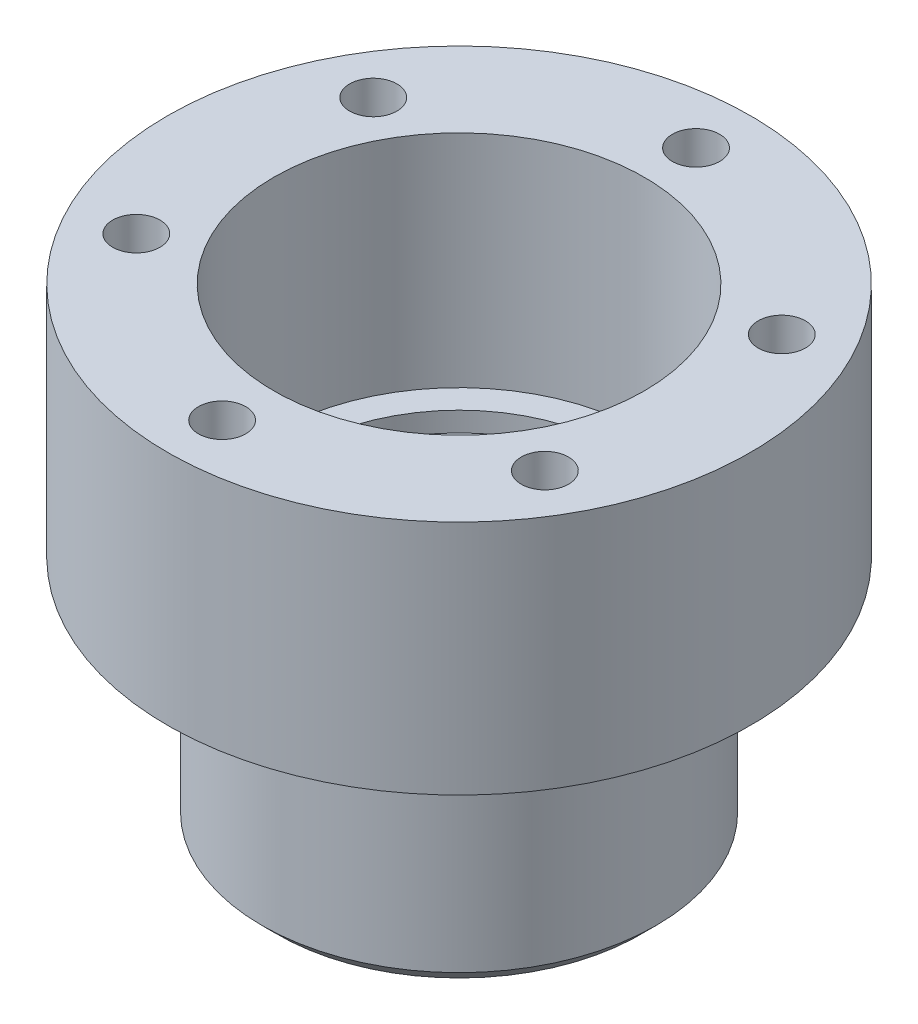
ISO-10303-21;
HEADER;
FILE_DESCRIPTION(('STEP AP214'),'2;1');
FILE_NAME('part.step','',(''),(''),'','','');
FILE_SCHEMA(('AUTOMOTIVE_DESIGN { 1 0 10303 214 1 1 1 1 }'));
ENDSEC;
DATA;
#1=APPLICATION_CONTEXT('core data for automotive mechanical design processes');
#2=APPLICATION_PROTOCOL_DEFINITION('international standard','automotive_design',2000,#1);
#3=PRODUCT_CONTEXT('',#1,'mechanical');
#4=PRODUCT('Part','Part','',(#3));
#5=PRODUCT_RELATED_PRODUCT_CATEGORY('part','',(#4));
#6=PRODUCT_DEFINITION_FORMATION('','',#4);
#7=PRODUCT_DEFINITION_CONTEXT('part definition',#1,'design');
#8=PRODUCT_DEFINITION('design','',#6,#7);
#9=PRODUCT_DEFINITION_SHAPE('','',#8);
#10=(LENGTH_UNIT() NAMED_UNIT(*) SI_UNIT(.MILLI.,.METRE.));
#11=(NAMED_UNIT(*) PLANE_ANGLE_UNIT() SI_UNIT($,.RADIAN.));
#12=(NAMED_UNIT(*) SI_UNIT($,.STERADIAN.) SOLID_ANGLE_UNIT());
#13=UNCERTAINTY_MEASURE_WITH_UNIT(LENGTH_MEASURE(1.E-05),#10,'distance_accuracy_value','');
#14=(GEOMETRIC_REPRESENTATION_CONTEXT(3) GLOBAL_UNCERTAINTY_ASSIGNED_CONTEXT((#13)) GLOBAL_UNIT_ASSIGNED_CONTEXT((#10,
#11,#12)) REPRESENTATION_CONTEXT('',''));
#15=CARTESIAN_POINT('',(0.,0.,0.));
#16=DIRECTION('',(0.,0.,1.));
#17=DIRECTION('',(1.,0.,0.));
#18=AXIS2_PLACEMENT_3D('',#15,#16,#17);
#19=CARTESIAN_POINT('',(-7.02103754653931,-29.6345611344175,0.));
#20=DIRECTION('',(0.,-1.,0.));
#21=DIRECTION('',(0.,0.,-1.));
#22=AXIS2_PLACEMENT_3D('',#19,#20,#21);
#23=PLANE('',#22);
#24=CARTESIAN_POINT('',(13.6039624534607,-29.6345611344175,0.));
#25=DIRECTION('',(0.,1.,0.));
#26=DIRECTION('',(-1.,0.,0.));
#27=AXIS2_PLACEMENT_3D('',#24,#25,#26);
#28=CIRCLE('',#27,20.);
#29=CARTESIAN_POINT('',(-6.39603754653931,-29.6345611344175,0.));
#30=VERTEX_POINT('',#29);
#31=EDGE_CURVE('E18',#30,#30,#28,.T.);
#32=ORIENTED_EDGE('',*,*,#31,.T.);
#33=EDGE_LOOP('',(#32));
#34=FACE_BOUND('',#33,.T.);
#35=CARTESIAN_POINT('',(13.6039624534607,-29.6345611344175,0.));
#36=DIRECTION('',(0.,1.,0.));
#37=DIRECTION('',(-1.,0.,0.));
#38=AXIS2_PLACEMENT_3D('',#35,#36,#37);
#39=CIRCLE('',#38,21.25);
#40=CARTESIAN_POINT('',(-7.6460375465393,-29.6345611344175,0.));
#41=VERTEX_POINT('',#40);
#42=EDGE_CURVE('E102',#41,#41,#39,.F.);
#43=ORIENTED_EDGE('',*,*,#42,.T.);
#44=EDGE_LOOP('',(#43));
#45=FACE_BOUND('',#44,.T.);
#46=ADVANCED_FACE('F14',(#34,#45),#23,.T.);
#47=CARTESIAN_POINT('',(13.6039624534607,-20.8845611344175,0.));
#48=DIRECTION('',(0.,1.,0.));
#49=DIRECTION('',(-1.,0.,0.));
#50=AXIS2_PLACEMENT_3D('',#47,#48,#49);
#51=CYLINDRICAL_SURFACE('',#50,20.);
#52=ORIENTED_EDGE('',*,*,#31,.F.);
#53=EDGE_LOOP('',(#52));
#54=FACE_BOUND('',#53,.T.);
#55=CARTESIAN_POINT('',(13.6039624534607,-12.1345611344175,0.));
#56=DIRECTION('',(0.,1.,0.));
#57=DIRECTION('',(-1.,0.,0.));
#58=AXIS2_PLACEMENT_3D('',#55,#56,#57);
#59=CIRCLE('',#58,20.);
#60=CARTESIAN_POINT('',(-6.39603754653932,-12.1345611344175,0.));
#61=VERTEX_POINT('',#60);
#62=EDGE_CURVE('E100',#61,#61,#59,.F.);
#63=ORIENTED_EDGE('',*,*,#62,.F.);
#64=EDGE_LOOP('',(#63));
#65=FACE_BOUND('',#64,.T.);
#66=ADVANCED_FACE('F110',(#54,#65),#51,.F.);
#67=CARTESIAN_POINT('',(13.6039624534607,-30.5595611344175,0.));
#68=DIRECTION('',(0.,1.,0.));
#69=DIRECTION('',(-1.,0.,0.));
#70=AXIS2_PLACEMENT_3D('',#67,#68,#69);
#71=CYLINDRICAL_SURFACE('',#70,21.25);
#72=CARTESIAN_POINT('',(13.6039624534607,-31.4845611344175,0.));
#73=DIRECTION('',(0.,1.,0.));
#74=DIRECTION('',(-1.,0.,0.));
#75=AXIS2_PLACEMENT_3D('',#72,#73,#74);
#76=CIRCLE('',#75,21.25);
#77=CARTESIAN_POINT('',(-7.6460375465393,-31.4845611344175,0.));
#78=VERTEX_POINT('',#77);
#79=EDGE_CURVE('E97',#78,#78,#76,.T.);
#80=ORIENTED_EDGE('',*,*,#79,.F.);
#81=EDGE_LOOP('',(#80));
#82=FACE_BOUND('',#81,.T.);
#83=ORIENTED_EDGE('',*,*,#42,.F.);
#84=EDGE_LOOP('',(#83));
#85=FACE_BOUND('',#84,.T.);
#86=ADVANCED_FACE('F113',(#82,#85),#71,.F.);
#87=CARTESIAN_POINT('',(-4.39603754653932,-12.1345611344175,0.));
#88=DIRECTION('',(0.,-1.,0.));
#89=DIRECTION('',(0.,0.,-1.));
#90=AXIS2_PLACEMENT_3D('',#87,#88,#89);
#91=PLANE('',#90);
#92=CARTESIAN_POINT('',(13.6039624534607,-12.1345611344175,0.));
#93=DIRECTION('',(0.,1.,0.));
#94=DIRECTION('',(-1.,0.,0.));
#95=AXIS2_PLACEMENT_3D('',#92,#93,#94);
#96=CIRCLE('',#95,16.);
#97=CARTESIAN_POINT('',(-2.39603754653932,-12.1345611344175,0.));
#98=VERTEX_POINT('',#97);
#99=EDGE_CURVE('E94',#98,#98,#96,.T.);
#100=ORIENTED_EDGE('',*,*,#99,.T.);
#101=EDGE_LOOP('',(#100));
#102=FACE_BOUND('',#101,.T.);
#103=ORIENTED_EDGE('',*,*,#62,.T.);
#104=EDGE_LOOP('',(#103));
#105=FACE_BOUND('',#104,.T.);
#106=ADVANCED_FACE('F117',(#102,#105),#91,.T.);
#107=CARTESIAN_POINT('',(-7.02103754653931,-31.4845611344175,0.));
#108=DIRECTION('',(0.,1.,0.));
#109=DIRECTION('',(0.,0.,1.));
#110=AXIS2_PLACEMENT_3D('',#107,#108,#109);
#111=PLANE('',#110);
#112=CARTESIAN_POINT('',(13.6039624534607,-31.4845611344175,0.));
#113=DIRECTION('',(0.,1.,0.));
#114=DIRECTION('',(-1.,0.,0.));
#115=AXIS2_PLACEMENT_3D('',#112,#113,#114);
#116=CIRCLE('',#115,20.);
#117=CARTESIAN_POINT('',(-6.39603754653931,-31.4845611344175,0.));
#118=VERTEX_POINT('',#117);
#119=EDGE_CURVE('E91',#118,#118,#116,.F.);
#120=ORIENTED_EDGE('',*,*,#119,.T.);
#121=EDGE_LOOP('',(#120));
#122=FACE_BOUND('',#121,.T.);
#123=ORIENTED_EDGE('',*,*,#79,.T.);
#124=EDGE_LOOP('',(#123));
#125=FACE_BOUND('',#124,.T.);
#126=ADVANCED_FACE('F119',(#122,#125),#111,.T.);
#127=CARTESIAN_POINT('',(13.6039624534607,-7.6345611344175,0.));
#128=DIRECTION('',(0.,1.,0.));
#129=DIRECTION('',(-1.,0.,0.));
#130=AXIS2_PLACEMENT_3D('',#127,#128,#129);
#131=CYLINDRICAL_SURFACE('',#130,16.);
#132=ORIENTED_EDGE('',*,*,#99,.F.);
#133=EDGE_LOOP('',(#132));
#134=FACE_BOUND('',#133,.T.);
#135=CARTESIAN_POINT('',(13.6039624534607,-3.1345611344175,0.));
#136=DIRECTION('',(0.,1.,0.));
#137=DIRECTION('',(-1.,0.,0.));
#138=AXIS2_PLACEMENT_3D('',#135,#136,#137);
#139=CIRCLE('',#138,16.);
#140=CARTESIAN_POINT('',(-2.39603754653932,-3.13456113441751,0.));
#141=VERTEX_POINT('',#140);
#142=EDGE_CURVE('E88',#141,#141,#139,.F.);
#143=ORIENTED_EDGE('',*,*,#142,.F.);
#144=EDGE_LOOP('',(#143));
#145=FACE_BOUND('',#144,.T.);
#146=ADVANCED_FACE('F125',(#134,#145),#131,.F.);
#147=CARTESIAN_POINT('',(13.6039624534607,-32.0595611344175,0.));
#148=DIRECTION('',(0.,1.,0.));
#149=DIRECTION('',(-1.,0.,0.));
#150=AXIS2_PLACEMENT_3D('',#147,#148,#149);
#151=CYLINDRICAL_SURFACE('',#150,20.);
#152=CARTESIAN_POINT('',(13.6039624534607,-32.6345611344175,0.));
#153=DIRECTION('',(0.,1.,0.));
#154=DIRECTION('',(-1.,0.,0.));
#155=AXIS2_PLACEMENT_3D('',#152,#153,#154);
#156=CIRCLE('',#155,20.);
#157=CARTESIAN_POINT('',(-6.39603754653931,-32.6345611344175,0.));
#158=VERTEX_POINT('',#157);
#159=EDGE_CURVE('E85',#158,#158,#156,.T.);
#160=ORIENTED_EDGE('',*,*,#159,.F.);
#161=EDGE_LOOP('',(#160));
#162=FACE_BOUND('',#161,.T.);
#163=ORIENTED_EDGE('',*,*,#119,.F.);
#164=EDGE_LOOP('',(#163));
#165=FACE_BOUND('',#164,.T.);
#166=ADVANCED_FACE('F214',(#162,#165),#151,.F.);
#167=CARTESIAN_POINT('',(-4.39603754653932,-3.13456113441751,0.));
#168=DIRECTION('',(0.,1.,0.));
#169=DIRECTION('',(0.,0.,1.));
#170=AXIS2_PLACEMENT_3D('',#167,#168,#169);
#171=PLANE('',#170);
#172=ORIENTED_EDGE('',*,*,#142,.T.);
#173=EDGE_LOOP('',(#172));
#174=FACE_BOUND('',#173,.T.);
#175=CARTESIAN_POINT('',(13.6039624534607,-3.1345611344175,0.));
#176=DIRECTION('',(0.,1.,0.));
#177=DIRECTION('',(-1.,0.,0.));
#178=AXIS2_PLACEMENT_3D('',#175,#176,#177);
#179=CIRCLE('',#178,20.);
#180=CARTESIAN_POINT('',(-6.39603754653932,-3.13456113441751,0.));
#181=VERTEX_POINT('',#180);
#182=EDGE_CURVE('E82',#181,#181,#179,.T.);
#183=ORIENTED_EDGE('',*,*,#182,.T.);
#184=EDGE_LOOP('',(#183));
#185=FACE_BOUND('',#184,.T.);
#186=ADVANCED_FACE('F210',(#174,#185),#171,.T.);
#187=CARTESIAN_POINT('',(-8.89603754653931,-32.6345611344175,0.));
#188=DIRECTION('',(0.,-1.,0.));
#189=DIRECTION('',(0.,0.,-1.));
#190=AXIS2_PLACEMENT_3D('',#187,#188,#189);
#191=PLANE('',#190);
#192=ORIENTED_EDGE('',*,*,#159,.T.);
#193=EDGE_LOOP('',(#192));
#194=FACE_BOUND('',#193,.T.);
#195=CARTESIAN_POINT('',(13.6039624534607,-32.6345611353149,0.));
#196=DIRECTION('',(0.,1.,0.));
#197=DIRECTION('',(-1.,0.,0.));
#198=AXIS2_PLACEMENT_3D('',#195,#196,#197);
#199=CIRCLE('',#198,23.0000000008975);
#200=CARTESIAN_POINT('',(-9.39603754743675,-32.634561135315,0.));
#201=VERTEX_POINT('',#200);
#202=EDGE_CURVE('E79',#201,#201,#199,.T.);
#203=ORIENTED_EDGE('',*,*,#202,.F.);
#204=EDGE_LOOP('',(#203));
#205=FACE_BOUND('',#204,.T.);
#206=ADVANCED_FACE('F206',(#194,#205),#191,.T.);
#207=CARTESIAN_POINT('',(13.6039624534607,12.1154388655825,0.));
#208=DIRECTION('',(0.,1.,0.));
#209=DIRECTION('',(-1.,0.,0.));
#210=AXIS2_PLACEMENT_3D('',#207,#208,#209);
#211=CYLINDRICAL_SURFACE('',#210,20.);
#212=ORIENTED_EDGE('',*,*,#182,.F.);
#213=EDGE_LOOP('',(#212));
#214=FACE_BOUND('',#213,.T.);
#215=CARTESIAN_POINT('',(13.6039624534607,-0.634561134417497,0.));
#216=DIRECTION('',(0.,1.,0.));
#217=DIRECTION('',(-1.,0.,0.));
#218=AXIS2_PLACEMENT_3D('',#215,#216,#217);
#219=CIRCLE('',#218,20.);
#220=CARTESIAN_POINT('',(-6.39603754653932,-0.634561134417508,0.));
#221=VERTEX_POINT('',#220);
#222=EDGE_CURVE('E76',#221,#221,#219,.T.);
#223=ORIENTED_EDGE('',*,*,#222,.T.);
#224=EDGE_LOOP('',(#223));
#225=FACE_BOUND('',#224,.T.);
#226=ADVANCED_FACE('F202',(#214,#225),#211,.F.);
#227=CARTESIAN_POINT('',(13.6039624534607,-30.63456113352,0.));
#228=DIRECTION('',(0.,1.,0.));
#229=DIRECTION('',(-1.,0.,0.));
#230=AXIS2_PLACEMENT_3D('',#227,#228,#229);
#231=CONICAL_SURFACE('',#230,24.9999999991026,0.7853981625);
#232=ORIENTED_EDGE('',*,*,#202,.T.);
#233=EDGE_LOOP('',(#232));
#234=FACE_BOUND('',#233,.T.);
#235=CARTESIAN_POINT('',(13.6039624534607,-30.6345611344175,0.));
#236=DIRECTION('',(0.,1.,0.));
#237=DIRECTION('',(-1.,0.,0.));
#238=AXIS2_PLACEMENT_3D('',#235,#236,#237);
#239=CIRCLE('',#238,25.);
#240=CARTESIAN_POINT('',(-11.3960375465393,-30.6345611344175,0.));
#241=VERTEX_POINT('',#240);
#242=EDGE_CURVE('E30',#241,#241,#239,.T.);
#243=ORIENTED_EDGE('',*,*,#242,.F.);
#244=EDGE_LOOP('',(#243));
#245=FACE_BOUND('',#244,.T.);
#246=ADVANCED_FACE('F198',(#234,#245),#231,.T.);
#247=CARTESIAN_POINT('',(13.6039624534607,-0.634561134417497,0.));
#248=DIRECTION('',(0.,-1.,0.));
#249=DIRECTION('',(0.,0.,-1.));
#250=AXIS2_PLACEMENT_3D('',#247,#248,#249);
#251=PLANE('',#250);
#252=ORIENTED_EDGE('',*,*,#222,.F.);
#253=EDGE_LOOP('',(#252));
#254=FACE_BOUND('',#253,.T.);
#255=CARTESIAN_POINT('',(13.6039624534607,-0.634561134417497,0.));
#256=DIRECTION('',(0.,-1.,0.));
#257=DIRECTION('',(1.,0.,0.));
#258=AXIS2_PLACEMENT_3D('',#255,#256,#257);
#259=CIRCLE('',#258,23.5);
#260=CARTESIAN_POINT('',(37.1039624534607,-0.634561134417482,0.));
#261=VERTEX_POINT('',#260);
#262=EDGE_CURVE('E73',#261,#261,#259,.F.);
#263=ORIENTED_EDGE('',*,*,#262,.T.);
#264=EDGE_LOOP('',(#263));
#265=FACE_BOUND('',#264,.T.);
#266=ADVANCED_FACE('F194',(#254,#265),#251,.F.);
#267=CARTESIAN_POINT('',(13.6039624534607,-17.6345611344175,0.));
#268=DIRECTION('',(0.,1.,0.));
#269=DIRECTION('',(-1.,0.,0.));
#270=AXIS2_PLACEMENT_3D('',#267,#268,#269);
#271=CYLINDRICAL_SURFACE('',#270,25.);
#272=CARTESIAN_POINT('',(13.6039624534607,-2.6345611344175,0.));
#273=DIRECTION('',(0.,1.,0.));
#274=DIRECTION('',(-1.,0.,0.));
#275=AXIS2_PLACEMENT_3D('',#272,#273,#274);
#276=CIRCLE('',#275,25.);
#277=CARTESIAN_POINT('',(-11.3960375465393,-2.63456113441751,0.));
#278=VERTEX_POINT('',#277);
#279=EDGE_CURVE('E52',#278,#278,#276,.T.);
#280=ORIENTED_EDGE('',*,*,#279,.F.);
#281=EDGE_LOOP('',(#280));
#282=FACE_BOUND('',#281,.T.);
#283=ORIENTED_EDGE('',*,*,#242,.T.);
#284=EDGE_LOOP('',(#283));
#285=FACE_BOUND('',#284,.T.);
#286=ADVANCED_FACE('F190',(#282,#285),#271,.T.);
#287=CARTESIAN_POINT('',(13.6039624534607,27.3654388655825,0.));
#288=DIRECTION('',(0.,-1.,0.));
#289=DIRECTION('',(1.,0.,0.));
#290=AXIS2_PLACEMENT_3D('',#287,#288,#289);
#291=CYLINDRICAL_SURFACE('',#290,23.5);
#292=ORIENTED_EDGE('',*,*,#262,.F.);
#293=EDGE_LOOP('',(#292));
#294=FACE_BOUND('',#293,.T.);
#295=CARTESIAN_POINT('',(13.6039624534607,27.3654388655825,0.));
#296=DIRECTION('',(0.,-1.,0.));
#297=DIRECTION('',(1.,0.,0.));
#298=AXIS2_PLACEMENT_3D('',#295,#296,#297);
#299=CIRCLE('',#298,23.5);
#300=CARTESIAN_POINT('',(37.1039624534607,27.3654388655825,0.));
#301=VERTEX_POINT('',#300);
#302=EDGE_CURVE('E49',#301,#301,#299,.T.);
#303=ORIENTED_EDGE('',*,*,#302,.F.);
#304=EDGE_LOOP('',(#303));
#305=FACE_BOUND('',#304,.T.);
#306=ADVANCED_FACE('F147',(#294,#305),#291,.F.);
#307=CARTESIAN_POINT('',(-12.3426675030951,27.3654388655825,-15.0591186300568));
#308=DIRECTION('',(0.,-1.,0.));
#309=DIRECTION('',(0.,0.,-1.));
#310=AXIS2_PLACEMENT_3D('',#307,#308,#309);
#311=CYLINDRICAL_SURFACE('',#310,3.);
#312=CARTESIAN_POINT('',(-12.3426675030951,27.3654388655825,-15.0591186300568));
#313=DIRECTION('',(0.,-1.,0.));
#314=DIRECTION('',(0.,0.,-1.));
#315=AXIS2_PLACEMENT_3D('',#312,#313,#314);
#316=CIRCLE('',#315,3.);
#317=CARTESIAN_POINT('',(-12.3426675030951,27.3654388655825,-18.0591186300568));
#318=VERTEX_POINT('',#317);
#319=EDGE_CURVE('E46',#318,#318,#316,.T.);
#320=ORIENTED_EDGE('',*,*,#319,.F.);
#321=EDGE_LOOP('',(#320));
#322=FACE_BOUND('',#321,.T.);
#323=CARTESIAN_POINT('',(-12.3426675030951,-2.63456113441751,-15.0591186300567));
#324=DIRECTION('',(0.,-1.,0.));
#325=DIRECTION('',(0.,0.,-1.));
#326=AXIS2_PLACEMENT_3D('',#323,#324,#325);
#327=CIRCLE('',#326,3.);
#328=CARTESIAN_POINT('',(-12.3426675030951,-2.63456113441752,-18.0591186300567));
#329=VERTEX_POINT('',#328);
#330=EDGE_CURVE('E70',#329,#329,#327,.F.);
#331=ORIENTED_EDGE('',*,*,#330,.F.);
#332=EDGE_LOOP('',(#331));
#333=FACE_BOUND('',#332,.T.);
#334=ADVANCED_FACE('F143',(#322,#333),#311,.F.);
#335=CARTESIAN_POINT('',(13.6722267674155,27.3654388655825,-30.));
#336=DIRECTION('',(0.,-1.,0.));
#337=DIRECTION('',(0.,0.,-1.));
#338=AXIS2_PLACEMENT_3D('',#335,#336,#337);
#339=CYLINDRICAL_SURFACE('',#338,3.);
#340=CARTESIAN_POINT('',(13.6722267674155,27.3654388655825,-30.));
#341=DIRECTION('',(0.,-1.,0.));
#342=DIRECTION('',(0.,0.,-1.));
#343=AXIS2_PLACEMENT_3D('',#340,#341,#342);
#344=CIRCLE('',#343,3.);
#345=CARTESIAN_POINT('',(13.6722267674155,27.3654388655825,-33.));
#346=VERTEX_POINT('',#345);
#347=EDGE_CURVE('E43',#346,#346,#344,.T.);
#348=ORIENTED_EDGE('',*,*,#347,.F.);
#349=EDGE_LOOP('',(#348));
#350=FACE_BOUND('',#349,.T.);
#351=CARTESIAN_POINT('',(13.6722267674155,-2.63456113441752,-30.));
#352=DIRECTION('',(0.,-1.,0.));
#353=DIRECTION('',(0.,0.,-1.));
#354=AXIS2_PLACEMENT_3D('',#351,#352,#353);
#355=CIRCLE('',#354,3.);
#356=CARTESIAN_POINT('',(13.6722267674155,-2.63456113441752,-33.));
#357=VERTEX_POINT('',#356);
#358=EDGE_CURVE('E67',#357,#357,#355,.F.);
#359=ORIENTED_EDGE('',*,*,#358,.F.);
#360=EDGE_LOOP('',(#359));
#361=FACE_BOUND('',#360,.T.);
#362=ADVANCED_FACE('F146',(#350,#361),#339,.F.);
#363=CARTESIAN_POINT('',(39.6188567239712,27.3654388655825,-14.9408813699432));
#364=DIRECTION('',(0.,-1.,0.));
#365=DIRECTION('',(0.,0.,-1.));
#366=AXIS2_PLACEMENT_3D('',#363,#364,#365);
#367=CYLINDRICAL_SURFACE('',#366,3.);
#368=CARTESIAN_POINT('',(39.6188567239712,27.3654388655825,-14.9408813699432));
#369=DIRECTION('',(0.,-1.,0.));
#370=DIRECTION('',(0.,0.,-1.));
#371=AXIS2_PLACEMENT_3D('',#368,#369,#370);
#372=CIRCLE('',#371,3.);
#373=CARTESIAN_POINT('',(39.6188567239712,27.3654388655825,-17.9408813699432));
#374=VERTEX_POINT('',#373);
#375=EDGE_CURVE('E40',#374,#374,#372,.T.);
#376=ORIENTED_EDGE('',*,*,#375,.F.);
#377=EDGE_LOOP('',(#376));
#378=FACE_BOUND('',#377,.T.);
#379=CARTESIAN_POINT('',(39.6188567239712,-2.63456113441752,-14.9408813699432));
#380=DIRECTION('',(0.,-1.,0.));
#381=DIRECTION('',(0.,0.,-1.));
#382=AXIS2_PLACEMENT_3D('',#379,#380,#381);
#383=CIRCLE('',#382,3.);
#384=CARTESIAN_POINT('',(39.6188567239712,-2.63456113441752,-17.9408813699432));
#385=VERTEX_POINT('',#384);
#386=EDGE_CURVE('E64',#385,#385,#383,.F.);
#387=ORIENTED_EDGE('',*,*,#386,.F.);
#388=EDGE_LOOP('',(#387));
#389=FACE_BOUND('',#388,.T.);
#390=ADVANCED_FACE('F151',(#378,#389),#367,.F.);
#391=CARTESIAN_POINT('',(39.5505924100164,27.3654388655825,15.0591186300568));
#392=DIRECTION('',(0.,-1.,0.));
#393=DIRECTION('',(0.,0.,-1.));
#394=AXIS2_PLACEMENT_3D('',#391,#392,#393);
#395=CYLINDRICAL_SURFACE('',#394,3.);
#396=CARTESIAN_POINT('',(39.5505924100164,27.3654388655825,15.0591186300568));
#397=DIRECTION('',(0.,-1.,0.));
#398=DIRECTION('',(0.,0.,-1.));
#399=AXIS2_PLACEMENT_3D('',#396,#397,#398);
#400=CIRCLE('',#399,3.);
#401=CARTESIAN_POINT('',(39.5505924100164,27.3654388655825,12.0591186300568));
#402=VERTEX_POINT('',#401);
#403=EDGE_CURVE('E37',#402,#402,#400,.T.);
#404=ORIENTED_EDGE('',*,*,#403,.F.);
#405=EDGE_LOOP('',(#404));
#406=FACE_BOUND('',#405,.T.);
#407=CARTESIAN_POINT('',(39.5505924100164,-2.63456113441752,15.0591186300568));
#408=DIRECTION('',(0.,-1.,0.));
#409=DIRECTION('',(0.,0.,-1.));
#410=AXIS2_PLACEMENT_3D('',#407,#408,#409);
#411=CIRCLE('',#410,3.);
#412=CARTESIAN_POINT('',(39.5505924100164,-2.63456113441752,12.0591186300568));
#413=VERTEX_POINT('',#412);
#414=EDGE_CURVE('E61',#413,#413,#411,.F.);
#415=ORIENTED_EDGE('',*,*,#414,.F.);
#416=EDGE_LOOP('',(#415));
#417=FACE_BOUND('',#416,.T.);
#418=ADVANCED_FACE('F155',(#406,#417),#395,.F.);
#419=CARTESIAN_POINT('',(-12.4109318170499,27.3654388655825,14.9408813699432));
#420=DIRECTION('',(0.,-1.,0.));
#421=DIRECTION('',(1.,0.,0.));
#422=AXIS2_PLACEMENT_3D('',#419,#420,#421);
#423=CYLINDRICAL_SURFACE('',#422,3.);
#424=CARTESIAN_POINT('',(-12.4109318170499,27.3654388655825,14.9408813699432));
#425=DIRECTION('',(0.,-1.,0.));
#426=DIRECTION('',(1.,0.,0.));
#427=AXIS2_PLACEMENT_3D('',#424,#425,#426);
#428=CIRCLE('',#427,3.);
#429=CARTESIAN_POINT('',(-9.41093181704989,27.3654388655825,14.9408813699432));
#430=VERTEX_POINT('',#429);
#431=EDGE_CURVE('E34',#430,#430,#428,.T.);
#432=ORIENTED_EDGE('',*,*,#431,.F.);
#433=EDGE_LOOP('',(#432));
#434=FACE_BOUND('',#433,.T.);
#435=CARTESIAN_POINT('',(-12.4109318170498,-2.63456113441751,14.9408813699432));
#436=DIRECTION('',(0.,-1.,0.));
#437=DIRECTION('',(1.,0.,0.));
#438=AXIS2_PLACEMENT_3D('',#435,#436,#437);
#439=CIRCLE('',#438,3.);
#440=CARTESIAN_POINT('',(-9.41093181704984,-2.63456113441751,14.9408813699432));
#441=VERTEX_POINT('',#440);
#442=EDGE_CURVE('E58',#441,#441,#439,.F.);
#443=ORIENTED_EDGE('',*,*,#442,.F.);
#444=EDGE_LOOP('',(#443));
#445=FACE_BOUND('',#444,.T.);
#446=ADVANCED_FACE('F158',(#434,#445),#423,.F.);
#447=CARTESIAN_POINT('',(13.5356981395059,27.3654388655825,30.));
#448=DIRECTION('',(0.,-1.,0.));
#449=DIRECTION('',(0.,0.,-1.));
#450=AXIS2_PLACEMENT_3D('',#447,#448,#449);
#451=CYLINDRICAL_SURFACE('',#450,3.);
#452=CARTESIAN_POINT('',(13.5356981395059,27.3654388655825,30.));
#453=DIRECTION('',(0.,-1.,0.));
#454=DIRECTION('',(0.,0.,-1.));
#455=AXIS2_PLACEMENT_3D('',#452,#453,#454);
#456=CIRCLE('',#455,3.);
#457=CARTESIAN_POINT('',(13.5356981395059,27.3654388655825,27.));
#458=VERTEX_POINT('',#457);
#459=EDGE_CURVE('E27',#458,#458,#456,.T.);
#460=ORIENTED_EDGE('',*,*,#459,.F.);
#461=EDGE_LOOP('',(#460));
#462=FACE_BOUND('',#461,.T.);
#463=CARTESIAN_POINT('',(13.5356981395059,-2.63456113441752,30.));
#464=DIRECTION('',(0.,-1.,0.));
#465=DIRECTION('',(0.,0.,-1.));
#466=AXIS2_PLACEMENT_3D('',#463,#464,#465);
#467=CIRCLE('',#466,3.);
#468=CARTESIAN_POINT('',(13.5356981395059,-2.63456113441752,27.));
#469=VERTEX_POINT('',#468);
#470=EDGE_CURVE('E55',#469,#469,#467,.F.);
#471=ORIENTED_EDGE('',*,*,#470,.F.);
#472=EDGE_LOOP('',(#471));
#473=FACE_BOUND('',#472,.T.);
#474=ADVANCED_FACE('F16',(#462,#473),#451,.F.);
#475=CARTESIAN_POINT('',(-17.3960375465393,-2.63456113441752,0.));
#476=DIRECTION('',(0.,-1.,0.));
#477=DIRECTION('',(0.,0.,-1.));
#478=AXIS2_PLACEMENT_3D('',#475,#476,#477);
#479=PLANE('',#478);
#480=ORIENTED_EDGE('',*,*,#279,.T.);
#481=EDGE_LOOP('',(#480));
#482=FACE_BOUND('',#481,.T.);
#483=ORIENTED_EDGE('',*,*,#470,.T.);
#484=EDGE_LOOP('',(#483));
#485=FACE_BOUND('',#484,.T.);
#486=ORIENTED_EDGE('',*,*,#442,.T.);
#487=EDGE_LOOP('',(#486));
#488=FACE_BOUND('',#487,.T.);
#489=ORIENTED_EDGE('',*,*,#414,.T.);
#490=EDGE_LOOP('',(#489));
#491=FACE_BOUND('',#490,.T.);
#492=ORIENTED_EDGE('',*,*,#386,.T.);
#493=EDGE_LOOP('',(#492));
#494=FACE_BOUND('',#493,.T.);
#495=ORIENTED_EDGE('',*,*,#358,.T.);
#496=EDGE_LOOP('',(#495));
#497=FACE_BOUND('',#496,.T.);
#498=ORIENTED_EDGE('',*,*,#330,.T.);
#499=EDGE_LOOP('',(#498));
#500=FACE_BOUND('',#499,.T.);
#501=CARTESIAN_POINT('',(13.6039624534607,-2.6345611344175,0.));
#502=DIRECTION('',(0.,1.,0.));
#503=DIRECTION('',(-1.,0.,0.));
#504=AXIS2_PLACEMENT_3D('',#501,#502,#503);
#505=CIRCLE('',#504,37.);
#506=CARTESIAN_POINT('',(-23.3960375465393,-2.63456113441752,0.));
#507=VERTEX_POINT('',#506);
#508=EDGE_CURVE('E22',#507,#507,#505,.T.);
#509=ORIENTED_EDGE('',*,*,#508,.F.);
#510=EDGE_LOOP('',(#509));
#511=FACE_BOUND('',#510,.T.);
#512=ADVANCED_FACE('F138',(#482,#485,#488,#491,#494,#497,#500,#511),#479,.T.);
#513=CARTESIAN_POINT('',(-14.8960375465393,27.3654388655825,0.));
#514=DIRECTION('',(0.,1.,0.));
#515=DIRECTION('',(0.,0.,1.));
#516=AXIS2_PLACEMENT_3D('',#513,#514,#515);
#517=PLANE('',#516);
#518=ORIENTED_EDGE('',*,*,#459,.T.);
#519=EDGE_LOOP('',(#518));
#520=FACE_BOUND('',#519,.T.);
#521=ORIENTED_EDGE('',*,*,#431,.T.);
#522=EDGE_LOOP('',(#521));
#523=FACE_BOUND('',#522,.T.);
#524=ORIENTED_EDGE('',*,*,#403,.T.);
#525=EDGE_LOOP('',(#524));
#526=FACE_BOUND('',#525,.T.);
#527=ORIENTED_EDGE('',*,*,#375,.T.);
#528=EDGE_LOOP('',(#527));
#529=FACE_BOUND('',#528,.T.);
#530=ORIENTED_EDGE('',*,*,#347,.T.);
#531=EDGE_LOOP('',(#530));
#532=FACE_BOUND('',#531,.T.);
#533=ORIENTED_EDGE('',*,*,#319,.T.);
#534=EDGE_LOOP('',(#533));
#535=FACE_BOUND('',#534,.T.);
#536=ORIENTED_EDGE('',*,*,#302,.T.);
#537=EDGE_LOOP('',(#536));
#538=FACE_BOUND('',#537,.T.);
#539=CARTESIAN_POINT('',(13.6039624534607,27.3654388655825,0.));
#540=DIRECTION('',(0.,1.,0.));
#541=DIRECTION('',(-1.,0.,0.));
#542=AXIS2_PLACEMENT_3D('',#539,#540,#541);
#543=CIRCLE('',#542,37.);
#544=CARTESIAN_POINT('',(-23.3960375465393,27.3654388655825,0.));
#545=VERTEX_POINT('',#544);
#546=EDGE_CURVE('E9',#545,#545,#543,.F.);
#547=ORIENTED_EDGE('',*,*,#546,.F.);
#548=EDGE_LOOP('',(#547));
#549=FACE_BOUND('',#548,.T.);
#550=ADVANCED_FACE('F133',(#520,#523,#526,#529,#532,#535,#538,#549),#517,.T.);
#551=CARTESIAN_POINT('',(13.6039624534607,12.3654388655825,0.));
#552=DIRECTION('',(0.,1.,0.));
#553=DIRECTION('',(-1.,0.,0.));
#554=AXIS2_PLACEMENT_3D('',#551,#552,#553);
#555=CYLINDRICAL_SURFACE('',#554,37.);
#556=ORIENTED_EDGE('',*,*,#508,.T.);
#557=EDGE_LOOP('',(#556));
#558=FACE_BOUND('',#557,.T.);
#559=ORIENTED_EDGE('',*,*,#546,.T.);
#560=EDGE_LOOP('',(#559));
#561=FACE_BOUND('',#560,.T.);
#562=ADVANCED_FACE('F131',(#558,#561),#555,.T.);
#563=CLOSED_SHELL('',(#46,#66,#86,#106,#126,#146,#166,#186,#206,#226,#246,#266,#286,#306,#334,
#362,#390,#418,#446,#474,#512,#550,#562));
#564=MANIFOLD_SOLID_BREP('B1',#563);
#565=ADVANCED_BREP_SHAPE_REPRESENTATION('',(#18,#564),#14);
#566=SHAPE_DEFINITION_REPRESENTATION(#9,#565);
ENDSEC;
END-ISO-10303-21;
